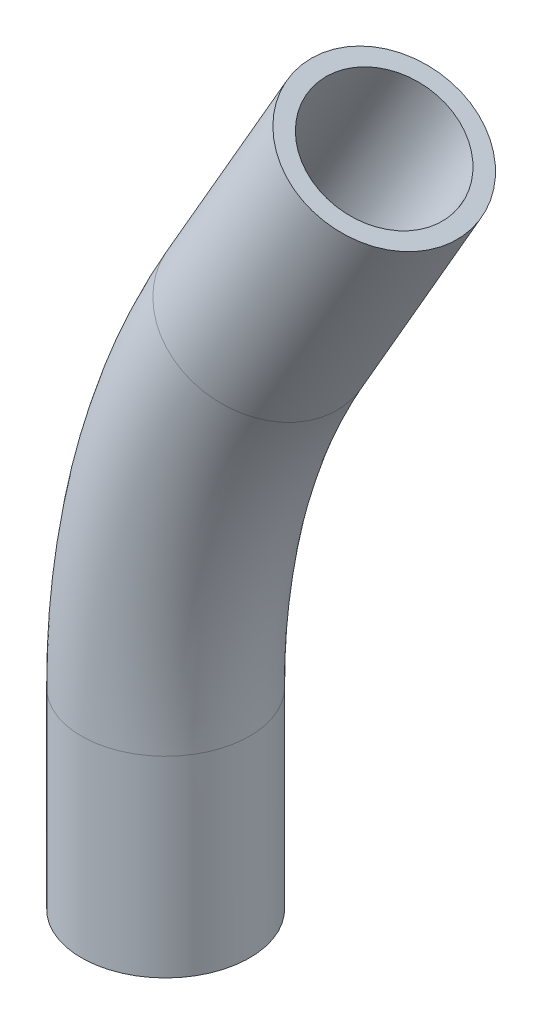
ISO-10303-21;
HEADER;
FILE_DESCRIPTION(('STEP AP214'),'2;1');
FILE_NAME('part.step','',(''),(''),'','','');
FILE_SCHEMA(('AUTOMOTIVE_DESIGN { 1 0 10303 214 1 1 1 1 }'));
ENDSEC;
DATA;
#1=APPLICATION_CONTEXT('core data for automotive mechanical design processes');
#2=APPLICATION_PROTOCOL_DEFINITION('international standard','automotive_design',2000,#1);
#3=PRODUCT_CONTEXT('',#1,'mechanical');
#4=PRODUCT('Part','Part','',(#3));
#5=PRODUCT_RELATED_PRODUCT_CATEGORY('part','',(#4));
#6=PRODUCT_DEFINITION_FORMATION('','',#4);
#7=PRODUCT_DEFINITION_CONTEXT('part definition',#1,'design');
#8=PRODUCT_DEFINITION('design','',#6,#7);
#9=PRODUCT_DEFINITION_SHAPE('','',#8);
#10=(LENGTH_UNIT() NAMED_UNIT(*) SI_UNIT(.MILLI.,.METRE.));
#11=(NAMED_UNIT(*) PLANE_ANGLE_UNIT() SI_UNIT($,.RADIAN.));
#12=(NAMED_UNIT(*) SI_UNIT($,.STERADIAN.) SOLID_ANGLE_UNIT());
#13=UNCERTAINTY_MEASURE_WITH_UNIT(LENGTH_MEASURE(1.E-05),#10,'distance_accuracy_value','');
#14=(GEOMETRIC_REPRESENTATION_CONTEXT(3) GLOBAL_UNCERTAINTY_ASSIGNED_CONTEXT((#13)) GLOBAL_UNIT_ASSIGNED_CONTEXT((#10,
#11,#12)) REPRESENTATION_CONTEXT('',''));
#15=CARTESIAN_POINT('',(0.,0.,0.));
#16=DIRECTION('',(0.,0.,1.));
#17=DIRECTION('',(1.,0.,0.));
#18=AXIS2_PLACEMENT_3D('',#15,#16,#17);
#19=CARTESIAN_POINT('',(0.,0.,0.));
#20=DIRECTION('',(0.,0.,1.));
#21=DIRECTION('',(1.,0.,0.));
#22=AXIS2_PLACEMENT_3D('',#19,#20,#21);
#23=TOROIDAL_SURFACE('',#22,146.05,16.7005);
#24=CARTESIAN_POINT('',(-126.483010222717,73.0250000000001,0.));
#25=DIRECTION('',(0.500000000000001,0.866025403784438,0.));
#26=DIRECTION('',(0.,0.,1.));
#27=AXIS2_PLACEMENT_3D('',#24,#25,#26);
#28=CIRCLE('',#27,16.7005);
#29=CARTESIAN_POINT('',(-140.946067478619,81.3752500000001,0.));
#30=VERTEX_POINT('',#29);
#31=EDGE_CURVE('E10',#30,#30,#28,.T.);
#32=CARTESIAN_POINT('',(-146.05,0.,0.));
#33=DIRECTION('',(0.,-1.,0.));
#34=DIRECTION('',(0.,0.,-1.));
#35=AXIS2_PLACEMENT_3D('',#32,#33,#34);
#36=CIRCLE('',#35,16.7005);
#37=CARTESIAN_POINT('',(-162.7505,0.,0.));
#38=VERTEX_POINT('',#37);
#39=EDGE_CURVE('E59',#38,#38,#36,.T.);
#40=CARTESIAN_POINT('',(0.,0.,0.));
#41=DIRECTION('',(0.,0.,1.));
#42=DIRECTION('',(1.,0.,0.));
#43=AXIS2_PLACEMENT_3D('',#40,#41,#42);
#44=CIRCLE('',#43,162.7505);
#45=EDGE_CURVE('',#30,#38,#44,.T.);
#46=ORIENTED_EDGE('',*,*,#31,.F.);
#47=ORIENTED_EDGE('',*,*,#39,.F.);
#48=ORIENTED_EDGE('',*,*,#45,.T.);
#49=ORIENTED_EDGE('',*,*,#45,.F.);
#50=EDGE_LOOP('',(#46,#48,#47,#49));
#51=FACE_BOUND('',#50,.T.);
#52=ADVANCED_FACE('F34',(#51),#23,.T.);
#53=CARTESIAN_POINT('',(0.,0.,0.));
#54=DIRECTION('',(0.,0.,1.));
#55=DIRECTION('',(1.,0.,0.));
#56=AXIS2_PLACEMENT_3D('',#53,#54,#55);
#57=TOROIDAL_SURFACE('',#56,146.05,13.3223);
#58=CARTESIAN_POINT('',(-126.483010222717,73.0250000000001,0.));
#59=DIRECTION('',(0.500000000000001,0.866025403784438,0.));
#60=DIRECTION('',(-0.866025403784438,0.500000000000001,0.));
#61=AXIS2_PLACEMENT_3D('',#58,#59,#60);
#62=CIRCLE('',#61,13.3223);
#63=CARTESIAN_POINT('',(-138.020460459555,79.6861500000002,0.));
#64=VERTEX_POINT('',#63);
#65=EDGE_CURVE('E53',#64,#64,#62,.T.);
#66=CARTESIAN_POINT('',(-146.05,0.,0.));
#67=DIRECTION('',(0.,1.,0.));
#68=DIRECTION('',(0.,0.,1.));
#69=AXIS2_PLACEMENT_3D('',#66,#67,#68);
#70=CIRCLE('',#69,13.3223);
#71=CARTESIAN_POINT('',(-159.3723,0.,0.));
#72=VERTEX_POINT('',#71);
#73=EDGE_CURVE('E40',#72,#72,#70,.T.);
#74=CARTESIAN_POINT('',(0.,0.,0.));
#75=DIRECTION('',(0.,0.,1.));
#76=DIRECTION('',(1.,0.,0.));
#77=AXIS2_PLACEMENT_3D('',#74,#75,#76);
#78=CIRCLE('',#77,159.3723);
#79=EDGE_CURVE('',#64,#72,#78,.T.);
#80=ORIENTED_EDGE('',*,*,#65,.T.);
#81=ORIENTED_EDGE('',*,*,#73,.F.);
#82=ORIENTED_EDGE('',*,*,#79,.T.);
#83=ORIENTED_EDGE('',*,*,#79,.F.);
#84=EDGE_LOOP('',(#80,#82,#81,#83));
#85=FACE_BOUND('',#84,.T.);
#86=ADVANCED_FACE('F85',(#85),#57,.F.);
#87=CARTESIAN_POINT('',(-102.670510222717,114.269459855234,0.));
#88=DIRECTION('',(0.500000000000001,0.866025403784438,0.));
#89=DIRECTION('',(-0.866025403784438,0.500000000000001,0.));
#90=AXIS2_PLACEMENT_3D('',#87,#88,#89);
#91=PLANE('',#90);
#92=CARTESIAN_POINT('',(-102.670510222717,114.269459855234,0.));
#93=DIRECTION('',(0.500000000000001,0.866025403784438,0.));
#94=DIRECTION('',(-0.866025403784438,0.500000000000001,0.));
#95=AXIS2_PLACEMENT_3D('',#92,#93,#94);
#96=CIRCLE('',#95,16.7005);
#97=CARTESIAN_POINT('',(-117.133567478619,122.619709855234,0.));
#98=VERTEX_POINT('',#97);
#99=EDGE_CURVE('E44',#98,#98,#96,.T.);
#100=ORIENTED_EDGE('',*,*,#99,.T.);
#101=EDGE_LOOP('',(#100));
#102=FACE_BOUND('',#101,.T.);
#103=CARTESIAN_POINT('',(-102.670510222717,114.269459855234,0.));
#104=DIRECTION('',(0.500000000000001,0.866025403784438,0.));
#105=DIRECTION('',(-0.866025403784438,0.500000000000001,0.));
#106=AXIS2_PLACEMENT_3D('',#103,#104,#105);
#107=CIRCLE('',#106,13.3223);
#108=CARTESIAN_POINT('',(-114.207960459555,120.930609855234,0.));
#109=VERTEX_POINT('',#108);
#110=EDGE_CURVE('E48',#109,#109,#107,.T.);
#111=ORIENTED_EDGE('',*,*,#110,.F.);
#112=EDGE_LOOP('',(#111));
#113=FACE_BOUND('',#112,.T.);
#114=ADVANCED_FACE('F90',(#102,#113),#91,.T.);
#115=CARTESIAN_POINT('',(-102.670510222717,114.269459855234,0.));
#116=DIRECTION('',(-0.500000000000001,-0.866025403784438,0.));
#117=DIRECTION('',(0.866025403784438,-0.500000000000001,0.));
#118=AXIS2_PLACEMENT_3D('',#115,#116,#117);
#119=CYLINDRICAL_SURFACE('',#118,16.7005);
#120=ORIENTED_EDGE('',*,*,#99,.F.);
#121=EDGE_LOOP('',(#120));
#122=FACE_BOUND('',#121,.T.);
#123=ORIENTED_EDGE('',*,*,#31,.T.);
#124=EDGE_LOOP('',(#123));
#125=FACE_BOUND('',#124,.T.);
#126=ADVANCED_FACE('F80',(#122,#125),#119,.T.);
#127=CARTESIAN_POINT('',(-102.670510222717,114.269459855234,0.));
#128=DIRECTION('',(-0.500000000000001,-0.866025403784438,0.));
#129=DIRECTION('',(0.866025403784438,-0.500000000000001,0.));
#130=AXIS2_PLACEMENT_3D('',#127,#128,#129);
#131=CYLINDRICAL_SURFACE('',#130,13.3223);
#132=ORIENTED_EDGE('',*,*,#110,.T.);
#133=EDGE_LOOP('',(#132));
#134=FACE_BOUND('',#133,.T.);
#135=ORIENTED_EDGE('',*,*,#65,.F.);
#136=EDGE_LOOP('',(#135));
#137=FACE_BOUND('',#136,.T.);
#138=ADVANCED_FACE('F71',(#134,#137),#131,.F.);
#139=CARTESIAN_POINT('',(-146.05,-38.1,0.));
#140=DIRECTION('',(0.,-1.,0.));
#141=DIRECTION('',(0.,0.,-1.));
#142=AXIS2_PLACEMENT_3D('',#139,#140,#141);
#143=PLANE('',#142);
#144=CARTESIAN_POINT('',(-146.05,-38.1,0.));
#145=DIRECTION('',(0.,-1.,0.));
#146=DIRECTION('',(0.,0.,-1.));
#147=AXIS2_PLACEMENT_3D('',#144,#145,#146);
#148=CIRCLE('',#147,16.7005);
#149=CARTESIAN_POINT('',(-146.05,-38.1,-16.7005));
#150=VERTEX_POINT('',#149);
#151=EDGE_CURVE('E56',#150,#150,#148,.T.);
#152=ORIENTED_EDGE('',*,*,#151,.T.);
#153=EDGE_LOOP('',(#152));
#154=FACE_BOUND('',#153,.T.);
#155=CARTESIAN_POINT('',(-146.05,-38.1,0.));
#156=DIRECTION('',(0.,-1.,0.));
#157=DIRECTION('',(0.,0.,-1.));
#158=AXIS2_PLACEMENT_3D('',#155,#156,#157);
#159=CIRCLE('',#158,13.3223);
#160=CARTESIAN_POINT('',(-146.05,-38.1,-13.3223));
#161=VERTEX_POINT('',#160);
#162=EDGE_CURVE('E62',#161,#161,#159,.T.);
#163=ORIENTED_EDGE('',*,*,#162,.F.);
#164=EDGE_LOOP('',(#163));
#165=FACE_BOUND('',#164,.T.);
#166=ADVANCED_FACE('F68',(#154,#165),#143,.T.);
#167=CARTESIAN_POINT('',(-146.05,-38.1,0.));
#168=DIRECTION('',(0.,1.,0.));
#169=DIRECTION('',(0.,0.,1.));
#170=AXIS2_PLACEMENT_3D('',#167,#168,#169);
#171=CYLINDRICAL_SURFACE('',#170,16.7005);
#172=ORIENTED_EDGE('',*,*,#151,.F.);
#173=EDGE_LOOP('',(#172));
#174=FACE_BOUND('',#173,.T.);
#175=ORIENTED_EDGE('',*,*,#39,.T.);
#176=EDGE_LOOP('',(#175));
#177=FACE_BOUND('',#176,.T.);
#178=ADVANCED_FACE('F70',(#174,#177),#171,.T.);
#179=CARTESIAN_POINT('',(-146.05,-38.1,0.));
#180=DIRECTION('',(0.,1.,0.));
#181=DIRECTION('',(0.,0.,1.));
#182=AXIS2_PLACEMENT_3D('',#179,#180,#181);
#183=CYLINDRICAL_SURFACE('',#182,13.3223);
#184=ORIENTED_EDGE('',*,*,#162,.T.);
#185=EDGE_LOOP('',(#184));
#186=FACE_BOUND('',#185,.T.);
#187=ORIENTED_EDGE('',*,*,#73,.T.);
#188=EDGE_LOOP('',(#187));
#189=FACE_BOUND('',#188,.T.);
#190=ADVANCED_FACE('F66',(#186,#189),#183,.F.);
#191=CLOSED_SHELL('',(#52,#86,#114,#126,#138,#166,#178,#190));
#192=MANIFOLD_SOLID_BREP('B2',#191);
#193=ADVANCED_BREP_SHAPE_REPRESENTATION('',(#18,#192),#14);
#194=SHAPE_DEFINITION_REPRESENTATION(#9,#193);
ENDSEC;
END-ISO-10303-21;
